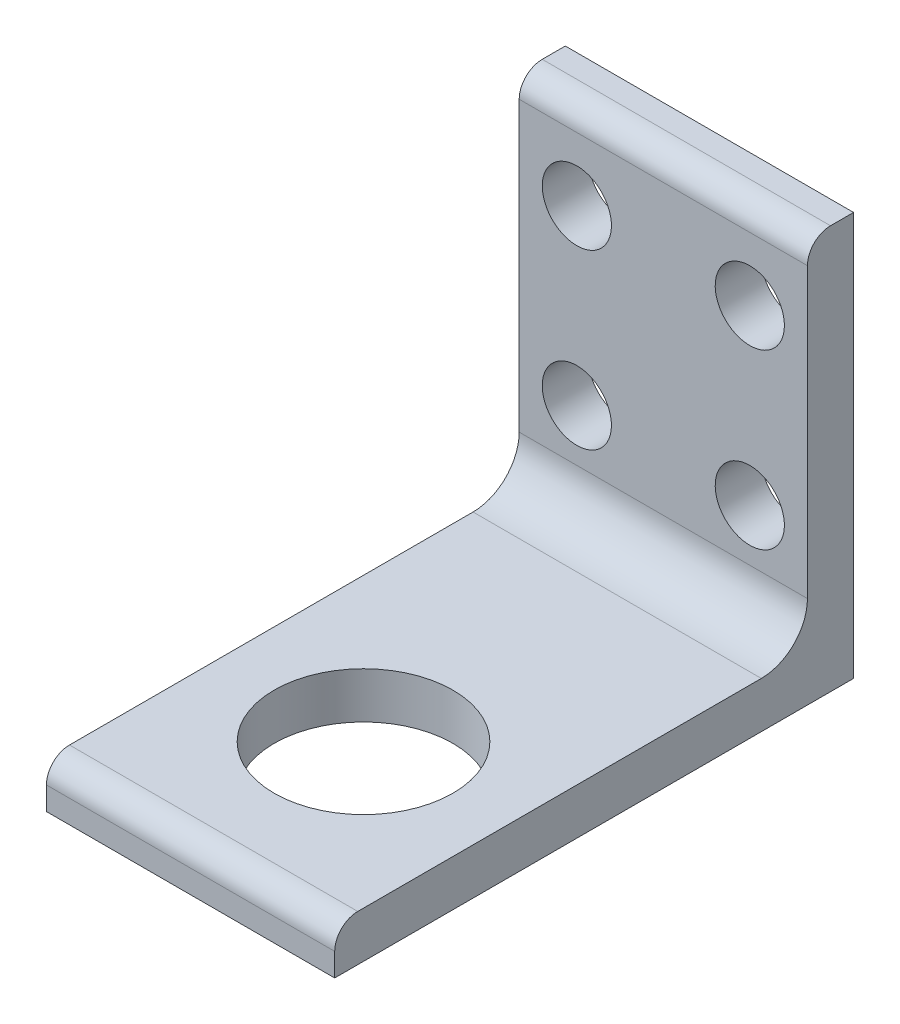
from build123d import *

# Parameters (mm, degrees)
CORNI_RES_AILES_IN_GALES_ET_COINS_AR_DEPTH = 50
ESQUISSE12_R                               = 15.5
ENL_V_MAT_EXTRU_1_DEPTH                    = 10
ESQUISSE13_R                               = 6
ENL_V_MAT_EXTRU_2_DEPTH                    = 10


with BuildPart() as part:
    # Esquisse19 → Corni_res _ ailes in_gales et _ coins ar (new body)
    with BuildSketch(Plane.YZ.offset(-25)):
        with BuildLine():
            Line((0, 90), (0, 0))
            Line((0, 0), (70, 0))
            Line((70, 0), (70, 4))
            ThreePointArc((70, 4), (68.828427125, 6.828427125), (66, 8))
            Line((66, 8), (16, 8))
            ThreePointArc((16, 8), (10.343145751, 10.343145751), (8, 16))
            Line((8, 16), (8, 86))
            ThreePointArc((8, 86), (6.828427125, 88.828427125), (4, 90))
            Line((4, 90), (0, 90))
        make_face()
    extrude(amount=CORNI_RES_AILES_IN_GALES_ET_COINS_AR_DEPTH)

    # Esquisse12 → Enl_v. mat.-Extru.1 (cut)
    with BuildSketch(Plane(origin=(0, 0, 0), x_dir=(-1, 0, 0), z_dir=(0, 1, 0))):
        with Locations(Location((0, 60, 0), (0, 0, 270))):
            Circle(ESQUISSE12_R)
    extrude(amount=ENL_V_MAT_EXTRU_1_DEPTH, mode=Mode.SUBTRACT)

    # Esquisse13 → Enl_v. mat.-Extru.2 (cut)
    with BuildSketch(Plane.XY):
        with Locations(Location((-15, 55, 0), (0, 0, 90))):
            Circle(ESQUISSE13_R)
        with Locations(Location((15, 55, 0), (0, 0, 90))):
            Circle(ESQUISSE13_R)
        with Locations(Location((15, 25, 0), (0, 0, 90))):
            Circle(ESQUISSE13_R)
        with Locations(Location((-15, 25, 0), (0, 0, 90))):
            Circle(ESQUISSE13_R)
    extrude(amount=ENL_V_MAT_EXTRU_2_DEPTH, mode=Mode.SUBTRACT)


solid = part.part
